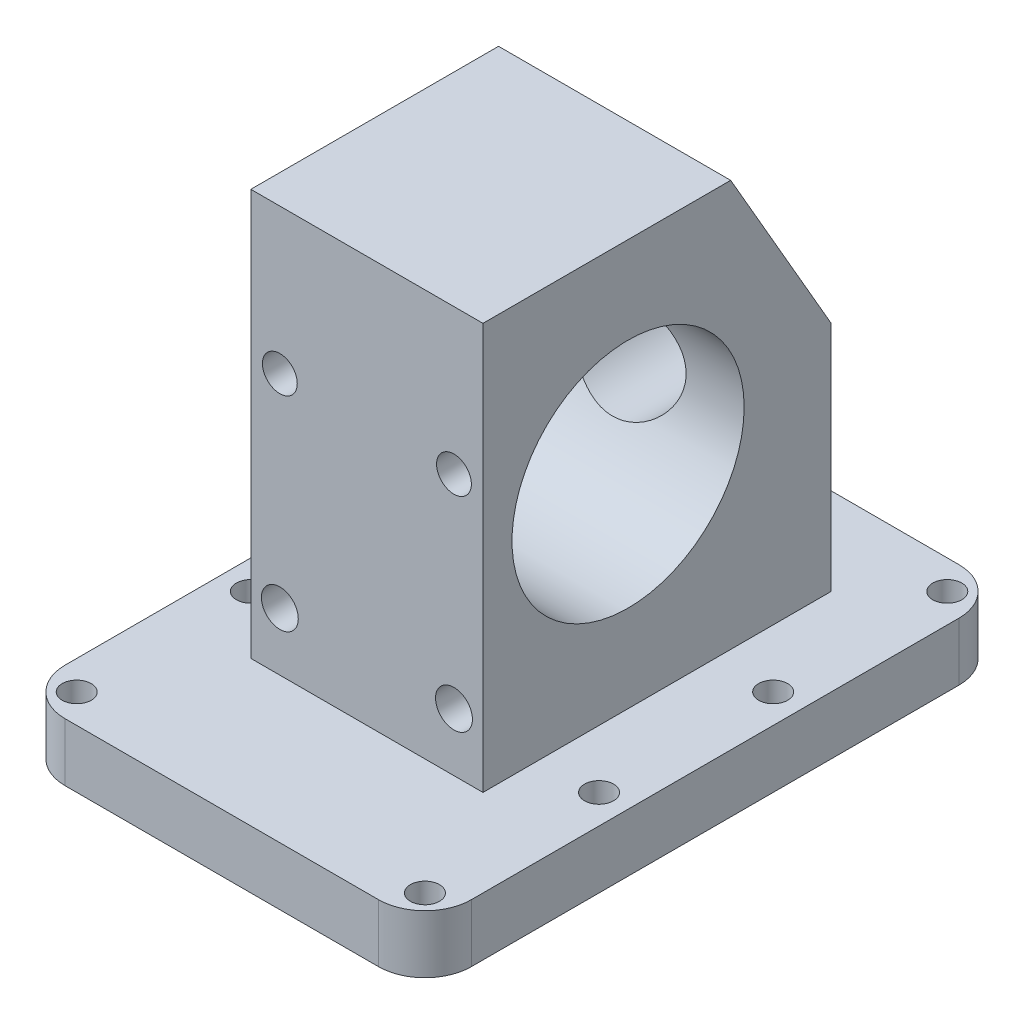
from build123d import *

# Parameters (mm, degrees)
SKETCH1_W                         = 60
SKETCH1_H                         = 70
BODY_DEPTH                        = 20
SKETCH17_R                        = 20
BIG_HOLE_DEPTH                    = 64.639610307
SKETCH7_W                         = 70
SKETCH7_H                         = 100
BASE_DEPTH                        = 10
CUT_EXTRUDE1_SLOPE_RIGHT_DEPTH    = 87.890735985
CUT_EXTRUDE_HOLE_RIGHT_REACH      = 104.347
CUT_EXTRUDE_HOLE_RIGHT_END_RADIUS = 20
SKETCH12_R                        = 10.005
F_6_0_6_DIAMETER_HOLE1_REACH      = 96.207
F_6_0_6_DIAMETER_HOLE1_BORE_R     = 3
F_1_4_0_25_DIAMETER_HOLE1_D       = 6.35
F_5_0_5_DIAMETER_HOLE1_D          = 5
LPATTERN5_COUNT                   = 3
LPATTERN5_PITCH                   = 30
LPATTERN5_COUNT_DIR2              = 2
LPATTERN5_PITCH_DIR2              = 60
M6X1_0_TAPPED_HOLE1_D             = 5
FILLET1_R                         = 8
LPATTERN6_COUNT                   = 4
LPATTERN6_PITCH                   = 10
LPATTERN6_COUNT_DIR2              = 3
LPATTERN6_PITCH_DIR2              = 6


with BuildPart() as part:
    # Sketch1 → BODY (new, symmetric)
    with BuildSketch(Plane(origin=(0, 0, 0), x_dir=(0, 0, -1), z_dir=(1, 0, 0))):
        with Locations((5, 0)):
            Rectangle(SKETCH1_W, SKETCH1_H)
    extrude(amount=BODY_DEPTH, both=True)

    # Sketch17 → Big Hole (cut, through all)
    with BuildSketch(Plane(origin=(20, 0, 0), x_dir=(0, 0, -1), z_dir=(1, 0, 0))):
        Circle(SKETCH17_R)
    extrude(amount=-BIG_HOLE_DEPTH, mode=Mode.SUBTRACT)

    # Sketch7 → BASE (add)
    with BuildSketch(Plane.XZ.offset(35)):
        Rectangle(SKETCH7_W, SKETCH7_H)
    extrude(amount=BASE_DEPTH)

    # Sketch18 → Cut-Extrude1_Slope_RIGHT (cut, through all)
    with BuildSketch(Plane(origin=(20, 0, 0), x_dir=(0, 0, -1), z_dir=(1, 0, 0))):
        Polygon((17.679491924, 35), (35, 5), (35, 35), align=None)
    extrude(amount=-CUT_EXTRUDE1_SLOPE_RIGHT_DEPTH, mode=Mode.SUBTRACT)

    # Cut-Extrude hole RIGHT: up to this cylinder (the profile starts outside it)
    cut_extrude_hole_right_end = Plane(origin=(0, 0, 0), z_dir=(1, 0, 0)) * Cylinder(CUT_EXTRUDE_HOLE_RIGHT_END_RADIUS, 249.694, mode=Mode.PRIVATE)
    # Sketch12 → Cut-Extrude hole RIGHT (cut, up to the surface)
    with BuildSketch(Plane(origin=(0, 0, -35), x_dir=(-1, 0, 0), z_dir=(0, 0, -1)), mode=Mode.PRIVATE) as cut_extrude_hole_right_sk1:
        Circle(SKETCH12_R)
    cut_extrude_hole_right_tool1 = extrude(cut_extrude_hole_right_sk1.sketch, amount=-CUT_EXTRUDE_HOLE_RIGHT_REACH, mode=Mode.PRIVATE) - cut_extrude_hole_right_end
    add(cut_extrude_hole_right_tool1.solids().sort_by_distance((0, 0, -35))[0], mode=Mode.SUBTRACT)

    # 6.0 _6_ Diameter Hole1 bore → 6.0 _6_ Diameter Hole1 (cut, up to next)
    with BuildSketch(Plane.XY.offset(25), mode=Mode.PRIVATE) as f_6_0_6_diameter_hole1_sk1:
        with Locations((15, 10)):
            Circle(F_6_0_6_DIAMETER_HOLE1_BORE_R)
    f_6_0_6_diameter_hole1_tool1 = extrude(f_6_0_6_diameter_hole1_sk1.sketch, amount=-F_6_0_6_DIAMETER_HOLE1_REACH, mode=Mode.PRIVATE) & part.part
    f_6_0_6_diameter_hole1 = f_6_0_6_diameter_hole1_tool1.solids().sort_by_distance((15, 10, 25))[0]
    add(f_6_0_6_diameter_hole1, mode=Mode.SUBTRACT)

    # Mirror1: 6.0 _6_ Diameter Hole1 across plane
    add(f_6_0_6_diameter_hole1.mirror(Plane(origin=(0, 0, 0), x_dir=(0, 0, 1), z_dir=(1, 0, 0))), mode=Mode.SUBTRACT)

    # 1_4 _0.25_ Diameter Hole1 (through all)
    with Locations(Plane.XY.offset(25)):
        with Locations((15, -25)):
            f_1_4_0_25_diameter_hole1 = Hole(F_1_4_0_25_DIAMETER_HOLE1_D / 2)

    # Mirror2: 1_4 _0.25_ Diameter Hole1 across plane
    add(f_1_4_0_25_diameter_hole1.mirror(Plane(origin=(0, 0, 0), x_dir=(0, 0, 1), z_dir=(1, 0, 0))), mode=Mode.SUBTRACT)

    # 5.0 _5_ Diameter Hole1 (through all)
    with Locations(Plane(origin=(0, -35, 0), x_dir=(-1, 0, 0), z_dir=(0, 1, 0))):
        with Locations((30, 45)):
            f_5_0_5_diameter_hole1 = Hole(F_5_0_5_DIAMETER_HOLE1_D / 2)

    # LPattern5: 5.0 _5_ Diameter Hole1 3 × 2
    with Locations(*[(j * LPATTERN5_PITCH_DIR2, 0, -i * LPATTERN5_PITCH) for i in range(LPATTERN5_COUNT) for j in range(LPATTERN5_COUNT_DIR2) if (i, j) != (0, 0)]):
        add(f_5_0_5_diameter_hole1, mode=Mode.SUBTRACT)

    # M6x1.0 Tapped Hole1 (through all)
    with Locations(Plane(origin=(0, -35, 0), x_dir=(1, 0, 0), z_dir=(0, 1, 0))):
        with Locations((-30, 45), (30, 45)):
            Hole(M6X1_0_TAPPED_HOLE1_D / 2)

    # Fillet1
    fillet1_edges = [part.edges().sort_by_distance(p)[0] for p in [
        (-35, -40, 50),
        (-35, -40, -50),
        (35, -40, -50),
        (35, -40, 50),
    ]]
    fillet(fillet1_edges, radius=FILLET1_R)

    # Sketch20 → M3x0.5 Tapped Hole1 (revolve, cut)
    with BuildSketch(Plane(origin=(15, 13.660254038, -30), x_dir=(0, 0.8660254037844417, 0.4999999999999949), z_dir=(1, 0, 0))):
        Polygon((0, 0), (0, 8.251075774), (1.25, 7.5), (1.25, 0), align=None)
    m3x0_5_tapped_hole1 = revolve(axis=Axis((15, 16.835254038, -35.499261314), (0, -0.49999999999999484, 0.8660254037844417)), mode=Mode.SUBTRACT)

    # LPattern6: M3x0.5 Tapped Hole1 4 × 3
    with Locations(*[Vector(-1, 0, 0) * (i * LPATTERN6_PITCH) + Vector(0, 0.8660254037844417, 0.49999999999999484) * (j * LPATTERN6_PITCH_DIR2) for i in range(LPATTERN6_COUNT) for j in range(LPATTERN6_COUNT_DIR2) if (i, j) != (0, 0)]):
        add(m3x0_5_tapped_hole1, mode=Mode.SUBTRACT)


solid = part.part
